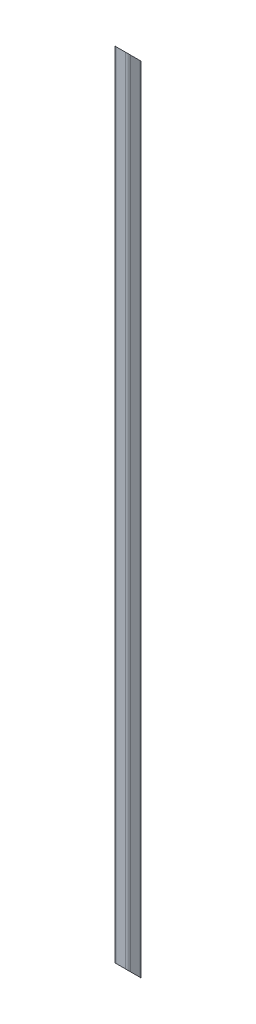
ISO-10303-21;
HEADER;
FILE_DESCRIPTION(('STEP AP214'),'2;1');
FILE_NAME('part.step','',(''),(''),'','','');
FILE_SCHEMA(('AUTOMOTIVE_DESIGN { 1 0 10303 214 1 1 1 1 }'));
ENDSEC;
DATA;
#1=APPLICATION_CONTEXT('core data for automotive mechanical design processes');
#2=APPLICATION_PROTOCOL_DEFINITION('international standard','automotive_design',2000,#1);
#3=PRODUCT_CONTEXT('',#1,'mechanical');
#4=PRODUCT('Part','Part','',(#3));
#5=PRODUCT_RELATED_PRODUCT_CATEGORY('part','',(#4));
#6=PRODUCT_DEFINITION_FORMATION('','',#4);
#7=PRODUCT_DEFINITION_CONTEXT('part definition',#1,'design');
#8=PRODUCT_DEFINITION('design','',#6,#7);
#9=PRODUCT_DEFINITION_SHAPE('','',#8);
#10=(LENGTH_UNIT() NAMED_UNIT(*) SI_UNIT(.MILLI.,.METRE.));
#11=(NAMED_UNIT(*) PLANE_ANGLE_UNIT() SI_UNIT($,.RADIAN.));
#12=(NAMED_UNIT(*) SI_UNIT($,.STERADIAN.) SOLID_ANGLE_UNIT());
#13=UNCERTAINTY_MEASURE_WITH_UNIT(LENGTH_MEASURE(1.E-05),#10,'distance_accuracy_value','');
#14=(GEOMETRIC_REPRESENTATION_CONTEXT(3) GLOBAL_UNCERTAINTY_ASSIGNED_CONTEXT((#13)) GLOBAL_UNIT_ASSIGNED_CONTEXT((#10,
#11,#12)) REPRESENTATION_CONTEXT('',''));
#15=CARTESIAN_POINT('',(0.,0.,0.));
#16=DIRECTION('',(0.,0.,1.));
#17=DIRECTION('',(1.,0.,0.));
#18=AXIS2_PLACEMENT_3D('',#15,#16,#17);
#19=CARTESIAN_POINT('',(12.9743199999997,2120.9,-12.9743199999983));
#20=DIRECTION('',(0.,-1.,0.));
#21=DIRECTION('',(0.,0.,-1.));
#22=AXIS2_PLACEMENT_3D('',#19,#20,#21);
#23=CYLINDRICAL_SURFACE('',#22,6.07568);
#24=DIRECTION('',(0.,-1.,0.));
#25=VECTOR('',#24,1.);
#26=CARTESIAN_POINT('',(12.9743199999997,2120.9,-19.0499999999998));
#27=LINE('',#26,#25);
#28=CARTESIAN_POINT('',(12.9743199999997,2082.8,-19.0499999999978));
#29=VERTEX_POINT('',#28);
#30=CARTESIAN_POINT('',(12.9743199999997,0.,-19.05));
#31=VERTEX_POINT('',#30);
#32=EDGE_CURVE('E217',#29,#31,#27,.T.);
#33=ORIENTED_EDGE('',*,*,#32,.F.);
#34=CARTESIAN_POINT('',(12.9743199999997,2088.87568,-12.9743199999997));
#35=DIRECTION('',(0.,-0.707106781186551,0.707106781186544));
#36=DIRECTION('',(0.,-0.707106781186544,-0.707106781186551));
#37=AXIS2_PLACEMENT_3D('',#34,#35,#36);
#38=ELLIPSE('',#37,8.59230905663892,6.07568);
#39=CARTESIAN_POINT('',(19.05,2088.87568,-12.9743199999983));
#40=VERTEX_POINT('',#39);
#41=EDGE_CURVE('E199',#29,#40,#38,.T.);
#42=ORIENTED_EDGE('',*,*,#41,.T.);
#43=DIRECTION('',(0.,-1.,0.));
#44=VECTOR('',#43,1.);
#45=CARTESIAN_POINT('',(19.05,2120.9,-12.9743199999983));
#46=LINE('',#45,#44);
#47=CARTESIAN_POINT('',(19.05,6.07567999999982,-12.9743199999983));
#48=VERTEX_POINT('',#47);
#49=EDGE_CURVE('E278',#40,#48,#46,.T.);
#50=ORIENTED_EDGE('',*,*,#49,.T.);
#51=CARTESIAN_POINT('',(12.9743199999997,6.07567999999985,-12.9743199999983));
#52=DIRECTION('',(0.,0.707106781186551,-0.707106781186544));
#53=DIRECTION('',(0.,-0.707106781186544,-0.707106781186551));
#54=AXIS2_PLACEMENT_3D('',#51,#52,#53);
#55=ELLIPSE('',#54,8.59230905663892,6.07568);
#56=EDGE_CURVE('E258',#48,#31,#55,.T.);
#57=ORIENTED_EDGE('',*,*,#56,.T.);
#58=EDGE_LOOP('',(#33,#42,#50,#57));
#59=FACE_BOUND('',#58,.T.);
#60=ADVANCED_FACE('F80',(#59),#23,.T.);
#61=CARTESIAN_POINT('',(-12.9743200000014,2120.9,-19.0499999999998));
#62=DIRECTION('',(0.,0.,1.));
#63=DIRECTION('',(1.,0.,0.));
#64=AXIS2_PLACEMENT_3D('',#61,#62,#63);
#65=PLANE('',#64);
#66=DIRECTION('',(0.,-1.,0.));
#67=VECTOR('',#66,1.);
#68=CARTESIAN_POINT('',(-12.9743200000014,2120.9,-19.0499999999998));
#69=LINE('',#68,#67);
#70=CARTESIAN_POINT('',(-12.9743200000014,2082.8,-19.0499999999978));
#71=VERTEX_POINT('',#70);
#72=CARTESIAN_POINT('',(-12.9743199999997,4.9960036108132E-13,-19.05));
#73=VERTEX_POINT('',#72);
#74=EDGE_CURVE('E215',#71,#73,#69,.T.);
#75=ORIENTED_EDGE('',*,*,#74,.F.);
#76=DIRECTION('',(-1.,0.,0.));
#77=VECTOR('',#76,1.);
#78=CARTESIAN_POINT('',(19.05,2082.8,-19.0499999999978));
#79=LINE('',#78,#77);
#80=EDGE_CURVE('E195',#29,#71,#79,.T.);
#81=ORIENTED_EDGE('',*,*,#80,.F.);
#82=ORIENTED_EDGE('',*,*,#32,.T.);
#83=DIRECTION('',(-1.,0.,0.));
#84=VECTOR('',#83,1.);
#85=CARTESIAN_POINT('',(-12.9743199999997,0.,-19.0500000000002));
#86=LINE('',#85,#84);
#87=EDGE_CURVE('E275',#31,#73,#86,.T.);
#88=ORIENTED_EDGE('',*,*,#87,.T.);
#89=EDGE_LOOP('',(#75,#81,#82,#88));
#90=FACE_BOUND('',#89,.T.);
#91=ADVANCED_FACE('F366',(#90),#65,.F.);
#92=CARTESIAN_POINT('',(-12.9743200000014,2120.9,-12.9743199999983));
#93=DIRECTION('',(0.,-1.,0.));
#94=DIRECTION('',(0.,0.,-1.));
#95=AXIS2_PLACEMENT_3D('',#92,#93,#94);
#96=CYLINDRICAL_SURFACE('',#95,6.07568);
#97=DIRECTION('',(0.,-1.,0.));
#98=VECTOR('',#97,1.);
#99=CARTESIAN_POINT('',(-19.05,2120.9,-12.9743199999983));
#100=LINE('',#99,#98);
#101=CARTESIAN_POINT('',(-19.05,2088.87568,-12.9743199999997));
#102=VERTEX_POINT('',#101);
#103=CARTESIAN_POINT('',(-19.05,6.07568000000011,-12.9743199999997));
#104=VERTEX_POINT('',#103);
#105=EDGE_CURVE('E206',#102,#104,#100,.T.);
#106=ORIENTED_EDGE('',*,*,#105,.F.);
#107=CARTESIAN_POINT('',(-12.9743200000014,2088.87568,-12.9743199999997));
#108=DIRECTION('',(0.,-0.707106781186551,0.707106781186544));
#109=DIRECTION('',(0.,-0.707106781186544,-0.707106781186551));
#110=AXIS2_PLACEMENT_3D('',#107,#108,#109);
#111=ELLIPSE('',#110,8.59230905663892,6.07568);
#112=EDGE_CURVE('E189',#102,#71,#111,.T.);
#113=ORIENTED_EDGE('',*,*,#112,.T.);
#114=ORIENTED_EDGE('',*,*,#74,.T.);
#115=CARTESIAN_POINT('',(-12.9743199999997,6.07568000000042,-12.9743200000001));
#116=DIRECTION('',(0.,0.707106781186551,-0.707106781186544));
#117=DIRECTION('',(0.,-0.707106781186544,-0.707106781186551));
#118=AXIS2_PLACEMENT_3D('',#115,#116,#117);
#119=ELLIPSE('',#118,8.59230905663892,6.07568);
#120=EDGE_CURVE('E214',#73,#104,#119,.T.);
#121=ORIENTED_EDGE('',*,*,#120,.T.);
#122=EDGE_LOOP('',(#106,#113,#114,#121));
#123=FACE_BOUND('',#122,.T.);
#124=ADVANCED_FACE('F212',(#123),#96,.T.);
#125=CARTESIAN_POINT('',(-19.05,2120.9,-12.9743199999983));
#126=DIRECTION('',(1.,0.,0.));
#127=DIRECTION('',(0.,0.,-1.));
#128=AXIS2_PLACEMENT_3D('',#125,#126,#127);
#129=PLANE('',#128);
#130=DIRECTION('',(0.,-1.,0.));
#131=VECTOR('',#130,1.);
#132=CARTESIAN_POINT('',(-19.05,2120.9,12.9743199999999));
#133=LINE('',#132,#131);
#134=CARTESIAN_POINT('',(-19.05,2114.82432,12.9743200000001));
#135=VERTEX_POINT('',#134);
#136=CARTESIAN_POINT('',(-19.05,32.0243199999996,12.9743200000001));
#137=VERTEX_POINT('',#136);
#138=EDGE_CURVE('E208',#135,#137,#133,.T.);
#139=ORIENTED_EDGE('',*,*,#138,.F.);
#140=DIRECTION('',(0.,0.707106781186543,0.707106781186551));
#141=VECTOR('',#140,1.);
#142=CARTESIAN_POINT('',(-19.05,2082.8,-19.0499999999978));
#143=LINE('',#142,#141);
#144=EDGE_CURVE('E192',#102,#135,#143,.T.);
#145=ORIENTED_EDGE('',*,*,#144,.F.);
#146=ORIENTED_EDGE('',*,*,#105,.T.);
#147=DIRECTION('',(0.,-0.707106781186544,-0.707106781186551));
#148=VECTOR('',#147,1.);
#149=CARTESIAN_POINT('',(-19.05,-1.38777878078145E-13,-19.0500000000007));
#150=LINE('',#149,#148);
#151=EDGE_CURVE('E298',#137,#104,#150,.T.);
#152=ORIENTED_EDGE('',*,*,#151,.F.);
#153=EDGE_LOOP('',(#139,#145,#146,#152));
#154=FACE_BOUND('',#153,.T.);
#155=ADVANCED_FACE('F204',(#154),#129,.F.);
#156=CARTESIAN_POINT('',(-12.9743200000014,2120.9,12.9743199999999));
#157=DIRECTION('',(0.,-1.,0.));
#158=DIRECTION('',(0.,0.,-1.));
#159=AXIS2_PLACEMENT_3D('',#156,#157,#158);
#160=CYLINDRICAL_SURFACE('',#159,6.07568);
#161=DIRECTION('',(0.,-1.,0.));
#162=VECTOR('',#161,1.);
#163=CARTESIAN_POINT('',(-12.9743200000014,2120.9,19.05));
#164=LINE('',#163,#162);
#165=CARTESIAN_POINT('',(-12.9743200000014,2120.9,19.05));
#166=VERTEX_POINT('',#165);
#167=CARTESIAN_POINT('',(-12.9743199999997,38.0999999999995,19.05));
#168=VERTEX_POINT('',#167);
#169=EDGE_CURVE('E219',#166,#168,#164,.T.);
#170=ORIENTED_EDGE('',*,*,#169,.F.);
#171=CARTESIAN_POINT('',(-12.9743200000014,2114.82432,12.9743200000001));
#172=DIRECTION('',(0.,-0.707106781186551,0.707106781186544));
#173=DIRECTION('',(0.,-0.707106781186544,-0.707106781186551));
#174=AXIS2_PLACEMENT_3D('',#171,#172,#173);
#175=ELLIPSE('',#174,8.59230905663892,6.07568);
#176=EDGE_CURVE('E200',#166,#135,#175,.T.);
#177=ORIENTED_EDGE('',*,*,#176,.T.);
#178=ORIENTED_EDGE('',*,*,#138,.T.);
#179=CARTESIAN_POINT('',(-12.9743199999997,32.0243199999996,12.9743200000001));
#180=DIRECTION('',(0.,0.707106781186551,-0.707106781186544));
#181=DIRECTION('',(0.,-0.707106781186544,-0.707106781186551));
#182=AXIS2_PLACEMENT_3D('',#179,#180,#181);
#183=ELLIPSE('',#182,8.59230905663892,6.07568);
#184=EDGE_CURVE('E249',#137,#168,#183,.T.);
#185=ORIENTED_EDGE('',*,*,#184,.T.);
#186=EDGE_LOOP('',(#170,#177,#178,#185));
#187=FACE_BOUND('',#186,.T.);
#188=ADVANCED_FACE('F295',(#187),#160,.T.);
#189=CARTESIAN_POINT('',(-12.9743200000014,2120.9,19.05));
#190=DIRECTION('',(0.,0.,-1.));
#191=DIRECTION('',(-1.,0.,0.));
#192=AXIS2_PLACEMENT_3D('',#189,#190,#191);
#193=PLANE('',#192);
#194=ORIENTED_EDGE('',*,*,#169,.T.);
#195=DIRECTION('',(-1.,0.,0.));
#196=VECTOR('',#195,1.);
#197=CARTESIAN_POINT('',(19.05,38.0999999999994,19.0500000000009));
#198=LINE('',#197,#196);
#199=CARTESIAN_POINT('',(12.9743199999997,38.0999999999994,19.0500000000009));
#200=VERTEX_POINT('',#199);
#201=EDGE_CURVE('E293',#200,#168,#198,.T.);
#202=ORIENTED_EDGE('',*,*,#201,.F.);
#203=DIRECTION('',(0.,-1.,0.));
#204=VECTOR('',#203,1.);
#205=CARTESIAN_POINT('',(12.9743199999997,2120.9,19.05));
#206=LINE('',#205,#204);
#207=CARTESIAN_POINT('',(12.9743199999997,2120.9,19.05));
#208=VERTEX_POINT('',#207);
#209=EDGE_CURVE('E284',#208,#200,#206,.T.);
#210=ORIENTED_EDGE('',*,*,#209,.F.);
#211=DIRECTION('',(1.,0.,0.));
#212=VECTOR('',#211,1.);
#213=CARTESIAN_POINT('',(-12.9743200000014,2120.9,19.05));
#214=LINE('',#213,#212);
#215=EDGE_CURVE('E276',#166,#208,#214,.T.);
#216=ORIENTED_EDGE('',*,*,#215,.F.);
#217=EDGE_LOOP('',(#194,#202,#210,#216));
#218=FACE_BOUND('',#217,.T.);
#219=ADVANCED_FACE('F291',(#218),#193,.F.);
#220=CARTESIAN_POINT('',(12.9743199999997,2120.9,12.9743199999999));
#221=DIRECTION('',(0.,-1.,0.));
#222=DIRECTION('',(0.,0.,-1.));
#223=AXIS2_PLACEMENT_3D('',#220,#221,#222);
#224=CYLINDRICAL_SURFACE('',#223,6.07568);
#225=DIRECTION('',(0.,-1.,0.));
#226=VECTOR('',#225,1.);
#227=CARTESIAN_POINT('',(19.05,2120.9,12.9743199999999));
#228=LINE('',#227,#226);
#229=CARTESIAN_POINT('',(19.05,2114.82432,12.9743200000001));
#230=VERTEX_POINT('',#229);
#231=CARTESIAN_POINT('',(19.05,32.0243200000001,12.9743200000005));
#232=VERTEX_POINT('',#231);
#233=EDGE_CURVE('E282',#230,#232,#228,.T.);
#234=ORIENTED_EDGE('',*,*,#233,.F.);
#235=CARTESIAN_POINT('',(12.9743199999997,2114.82432,12.9743200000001));
#236=DIRECTION('',(0.,-0.707106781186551,0.707106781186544));
#237=DIRECTION('',(0.,-0.707106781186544,-0.707106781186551));
#238=AXIS2_PLACEMENT_3D('',#235,#236,#237);
#239=ELLIPSE('',#238,8.59230905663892,6.07568);
#240=EDGE_CURVE('E94',#230,#208,#239,.T.);
#241=ORIENTED_EDGE('',*,*,#240,.T.);
#242=ORIENTED_EDGE('',*,*,#209,.T.);
#243=CARTESIAN_POINT('',(12.9743199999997,32.0243199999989,12.974320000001));
#244=DIRECTION('',(0.,0.707106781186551,-0.707106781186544));
#245=DIRECTION('',(0.,-0.707106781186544,-0.707106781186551));
#246=AXIS2_PLACEMENT_3D('',#243,#244,#245);
#247=ELLIPSE('',#246,8.59230905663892,6.07568);
#248=EDGE_CURVE('E245',#200,#232,#247,.T.);
#249=ORIENTED_EDGE('',*,*,#248,.T.);
#250=EDGE_LOOP('',(#234,#241,#242,#249));
#251=FACE_BOUND('',#250,.T.);
#252=ADVANCED_FACE('F357',(#251),#224,.T.);
#253=CARTESIAN_POINT('',(19.05,2120.9,-12.9743199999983));
#254=DIRECTION('',(-1.,0.,0.));
#255=DIRECTION('',(0.,0.,1.));
#256=AXIS2_PLACEMENT_3D('',#253,#254,#255);
#257=PLANE('',#256);
#258=ORIENTED_EDGE('',*,*,#49,.F.);
#259=DIRECTION('',(0.,0.707106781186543,0.707106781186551));
#260=VECTOR('',#259,1.);
#261=CARTESIAN_POINT('',(19.05,2082.8,-19.0499999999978));
#262=LINE('',#261,#260);
#263=EDGE_CURVE('E209',#40,#230,#262,.T.);
#264=ORIENTED_EDGE('',*,*,#263,.T.);
#265=ORIENTED_EDGE('',*,*,#233,.T.);
#266=DIRECTION('',(0.,-0.707106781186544,-0.707106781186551));
#267=VECTOR('',#266,1.);
#268=CARTESIAN_POINT('',(19.05,0.,-19.05));
#269=LINE('',#268,#267);
#270=EDGE_CURVE('E299',#232,#48,#269,.T.);
#271=ORIENTED_EDGE('',*,*,#270,.T.);
#272=EDGE_LOOP('',(#258,#264,#265,#271));
#273=FACE_BOUND('',#272,.T.);
#274=ADVANCED_FACE('F360',(#273),#257,.F.);
#275=CARTESIAN_POINT('',(12.9743199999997,2120.9,-12.9743199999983));
#276=DIRECTION('',(0.,-1.,0.));
#277=DIRECTION('',(0.,0.,-1.));
#278=AXIS2_PLACEMENT_3D('',#275,#276,#277);
#279=CYLINDRICAL_SURFACE('',#278,3.03784);
#280=CARTESIAN_POINT('',(12.9743199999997,2088.87568,-12.9743199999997));
#281=DIRECTION('',(0.,-0.707106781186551,0.707106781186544));
#282=DIRECTION('',(0.,-0.707106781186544,-0.707106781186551));
#283=AXIS2_PLACEMENT_3D('',#280,#281,#282);
#284=ELLIPSE('',#283,4.29615452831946,3.03784);
#285=CARTESIAN_POINT('',(12.9743199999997,2085.83784,-16.0121599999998));
#286=VERTEX_POINT('',#285);
#287=CARTESIAN_POINT('',(16.0121599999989,2088.87568,-12.9743199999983));
#288=VERTEX_POINT('',#287);
#289=EDGE_CURVE('E101',#286,#288,#284,.T.);
#290=ORIENTED_EDGE('',*,*,#289,.F.);
#291=DIRECTION('',(0.,-1.,0.));
#292=VECTOR('',#291,1.);
#293=CARTESIAN_POINT('',(12.9743199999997,2120.9,-16.0121600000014));
#294=LINE('',#293,#292);
#295=CARTESIAN_POINT('',(12.9743199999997,3.03784000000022,-16.0121600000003));
#296=VERTEX_POINT('',#295);
#297=EDGE_CURVE('E244',#286,#296,#294,.T.);
#298=ORIENTED_EDGE('',*,*,#297,.T.);
#299=CARTESIAN_POINT('',(12.9743199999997,6.07567999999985,-12.9743199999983));
#300=DIRECTION('',(0.,0.707106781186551,-0.707106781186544));
#301=DIRECTION('',(0.,-0.707106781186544,-0.707106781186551));
#302=AXIS2_PLACEMENT_3D('',#299,#300,#301);
#303=ELLIPSE('',#302,4.29615452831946,3.03784);
#304=CARTESIAN_POINT('',(16.0121600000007,6.07568000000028,-12.9743200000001));
#305=VERTEX_POINT('',#304);
#306=EDGE_CURVE('E232',#305,#296,#303,.T.);
#307=ORIENTED_EDGE('',*,*,#306,.F.);
#308=DIRECTION('',(0.,-1.,0.));
#309=VECTOR('',#308,1.);
#310=CARTESIAN_POINT('',(16.0121599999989,2120.9,-12.9743199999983));
#311=LINE('',#310,#309);
#312=EDGE_CURVE('E242',#288,#305,#311,.T.);
#313=ORIENTED_EDGE('',*,*,#312,.F.);
#314=EDGE_LOOP('',(#290,#298,#307,#313));
#315=FACE_BOUND('',#314,.T.);
#316=ADVANCED_FACE('F241',(#315),#279,.F.);
#317=CARTESIAN_POINT('',(-12.9743200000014,2120.9,-16.0121600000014));
#318=DIRECTION('',(0.,0.,1.));
#319=DIRECTION('',(1.,0.,0.));
#320=AXIS2_PLACEMENT_3D('',#317,#318,#319);
#321=PLANE('',#320);
#322=DIRECTION('',(1.,0.,0.));
#323=VECTOR('',#322,1.);
#324=CARTESIAN_POINT('',(-12.9743200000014,2085.83784,-16.0121599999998));
#325=LINE('',#324,#323);
#326=CARTESIAN_POINT('',(-12.9743200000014,2085.83784,-16.0121599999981));
#327=VERTEX_POINT('',#326);
#328=EDGE_CURVE('E351',#327,#286,#325,.T.);
#329=ORIENTED_EDGE('',*,*,#328,.F.);
#330=DIRECTION('',(0.,-1.,0.));
#331=VECTOR('',#330,1.);
#332=CARTESIAN_POINT('',(-12.9743200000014,2120.9,-16.0121600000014));
#333=LINE('',#332,#331);
#334=CARTESIAN_POINT('',(-12.9743199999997,3.03784000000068,-16.0121599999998));
#335=VERTEX_POINT('',#334);
#336=EDGE_CURVE('E272',#327,#335,#333,.T.);
#337=ORIENTED_EDGE('',*,*,#336,.T.);
#338=DIRECTION('',(-1.,0.,0.));
#339=VECTOR('',#338,1.);
#340=CARTESIAN_POINT('',(-12.9743199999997,3.03784000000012,-16.0121599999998));
#341=LINE('',#340,#339);
#342=EDGE_CURVE('E246',#296,#335,#341,.T.);
#343=ORIENTED_EDGE('',*,*,#342,.F.);
#344=ORIENTED_EDGE('',*,*,#297,.F.);
#345=EDGE_LOOP('',(#329,#337,#343,#344));
#346=FACE_BOUND('',#345,.T.);
#347=ADVANCED_FACE('F386',(#346),#321,.T.);
#348=CARTESIAN_POINT('',(-12.9743200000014,2120.9,-12.9743199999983));
#349=DIRECTION('',(0.,-1.,0.));
#350=DIRECTION('',(0.,0.,-1.));
#351=AXIS2_PLACEMENT_3D('',#348,#349,#350);
#352=CYLINDRICAL_SURFACE('',#351,3.03784);
#353=CARTESIAN_POINT('',(-12.9743200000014,2088.87568,-12.9743199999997));
#354=DIRECTION('',(0.,-0.707106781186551,0.707106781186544));
#355=DIRECTION('',(0.,-0.707106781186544,-0.707106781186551));
#356=AXIS2_PLACEMENT_3D('',#353,#354,#355);
#357=ELLIPSE('',#356,4.29615452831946,3.03784);
#358=CARTESIAN_POINT('',(-16.0121600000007,2088.87568,-12.9743199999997));
#359=VERTEX_POINT('',#358);
#360=EDGE_CURVE('E349',#359,#327,#357,.T.);
#361=ORIENTED_EDGE('',*,*,#360,.F.);
#362=DIRECTION('',(0.,-1.,0.));
#363=VECTOR('',#362,1.);
#364=CARTESIAN_POINT('',(-16.0121600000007,2120.9,-12.9743199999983));
#365=LINE('',#364,#363);
#366=CARTESIAN_POINT('',(-16.0121600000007,6.07568000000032,-12.9743200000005));
#367=VERTEX_POINT('',#366);
#368=EDGE_CURVE('E270',#359,#367,#365,.T.);
#369=ORIENTED_EDGE('',*,*,#368,.T.);
#370=CARTESIAN_POINT('',(-12.9743199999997,6.07568000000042,-12.9743200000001));
#371=DIRECTION('',(0.,0.707106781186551,-0.707106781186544));
#372=DIRECTION('',(0.,-0.707106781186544,-0.707106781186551));
#373=AXIS2_PLACEMENT_3D('',#370,#371,#372);
#374=ELLIPSE('',#373,4.29615452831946,3.03784);
#375=EDGE_CURVE('E251',#335,#367,#374,.T.);
#376=ORIENTED_EDGE('',*,*,#375,.F.);
#377=ORIENTED_EDGE('',*,*,#336,.F.);
#378=EDGE_LOOP('',(#361,#369,#376,#377));
#379=FACE_BOUND('',#378,.T.);
#380=ADVANCED_FACE('F389',(#379),#352,.F.);
#381=CARTESIAN_POINT('',(-16.0121600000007,2120.9,-12.9743199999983));
#382=DIRECTION('',(1.,0.,0.));
#383=DIRECTION('',(0.,0.,-1.));
#384=AXIS2_PLACEMENT_3D('',#381,#382,#383);
#385=PLANE('',#384);
#386=DIRECTION('',(0.,-0.707106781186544,-0.707106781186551));
#387=VECTOR('',#386,1.);
#388=CARTESIAN_POINT('',(-16.0121600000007,2104.88784,3.03784000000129));
#389=LINE('',#388,#387);
#390=CARTESIAN_POINT('',(-16.0121600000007,2114.82432,12.9743200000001));
#391=VERTEX_POINT('',#390);
#392=EDGE_CURVE('E326',#391,#359,#389,.T.);
#393=ORIENTED_EDGE('',*,*,#392,.F.);
#394=DIRECTION('',(0.,-1.,0.));
#395=VECTOR('',#394,1.);
#396=CARTESIAN_POINT('',(-16.0121600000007,2120.9,12.9743199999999));
#397=LINE('',#396,#395);
#398=CARTESIAN_POINT('',(-16.0121600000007,32.0243199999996,12.9743200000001));
#399=VERTEX_POINT('',#398);
#400=EDGE_CURVE('E268',#391,#399,#397,.T.);
#401=ORIENTED_EDGE('',*,*,#400,.T.);
#402=DIRECTION('',(0.,0.707106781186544,0.707106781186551));
#403=VECTOR('',#402,1.);
#404=CARTESIAN_POINT('',(-16.0121599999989,1063.48783999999,1044.43784));
#405=LINE('',#404,#403);
#406=EDGE_CURVE('E313',#367,#399,#405,.T.);
#407=ORIENTED_EDGE('',*,*,#406,.F.);
#408=ORIENTED_EDGE('',*,*,#368,.F.);
#409=EDGE_LOOP('',(#393,#401,#407,#408));
#410=FACE_BOUND('',#409,.T.);
#411=ADVANCED_FACE('F324',(#410),#385,.T.);
#412=CARTESIAN_POINT('',(-12.9743200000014,2120.9,12.9743199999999));
#413=DIRECTION('',(0.,-1.,0.));
#414=DIRECTION('',(0.,0.,-1.));
#415=AXIS2_PLACEMENT_3D('',#412,#413,#414);
#416=CYLINDRICAL_SURFACE('',#415,3.03784);
#417=CARTESIAN_POINT('',(-12.9743200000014,2114.82432,12.9743200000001));
#418=DIRECTION('',(0.,-0.707106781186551,0.707106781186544));
#419=DIRECTION('',(0.,-0.707106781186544,-0.707106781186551));
#420=AXIS2_PLACEMENT_3D('',#417,#418,#419);
#421=ELLIPSE('',#420,4.29615452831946,3.03784);
#422=CARTESIAN_POINT('',(-12.9743200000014,2117.86216,16.0121600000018));
#423=VERTEX_POINT('',#422);
#424=EDGE_CURVE('E330',#423,#391,#421,.T.);
#425=ORIENTED_EDGE('',*,*,#424,.F.);
#426=DIRECTION('',(0.,-1.,0.));
#427=VECTOR('',#426,1.);
#428=CARTESIAN_POINT('',(-12.9743200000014,2120.9,16.0121600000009));
#429=LINE('',#428,#427);
#430=CARTESIAN_POINT('',(-12.9743199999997,35.0621599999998,16.0121600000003));
#431=VERTEX_POINT('',#430);
#432=EDGE_CURVE('E266',#423,#431,#429,.T.);
#433=ORIENTED_EDGE('',*,*,#432,.T.);
#434=CARTESIAN_POINT('',(-12.9743199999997,32.0243199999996,12.9743200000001));
#435=DIRECTION('',(0.,0.707106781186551,-0.707106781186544));
#436=DIRECTION('',(0.,-0.707106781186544,-0.707106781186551));
#437=AXIS2_PLACEMENT_3D('',#434,#435,#436);
#438=ELLIPSE('',#437,4.29615452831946,3.03784);
#439=EDGE_CURVE('E310',#399,#431,#438,.T.);
#440=ORIENTED_EDGE('',*,*,#439,.F.);
#441=ORIENTED_EDGE('',*,*,#400,.F.);
#442=EDGE_LOOP('',(#425,#433,#440,#441));
#443=FACE_BOUND('',#442,.T.);
#444=ADVANCED_FACE('F329',(#443),#416,.F.);
#445=CARTESIAN_POINT('',(-12.9743200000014,2120.9,16.0121600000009));
#446=DIRECTION('',(0.,0.,-1.));
#447=DIRECTION('',(-1.,0.,0.));
#448=AXIS2_PLACEMENT_3D('',#445,#446,#447);
#449=PLANE('',#448);
#450=DIRECTION('',(-1.,0.,0.));
#451=VECTOR('',#450,1.);
#452=CARTESIAN_POINT('',(-12.9743200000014,2117.86216,16.0121600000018));
#453=LINE('',#452,#451);
#454=CARTESIAN_POINT('',(12.9743199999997,2117.86216,16.0121599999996));
#455=VERTEX_POINT('',#454);
#456=EDGE_CURVE('E337',#455,#423,#453,.T.);
#457=ORIENTED_EDGE('',*,*,#456,.F.);
#458=DIRECTION('',(0.,-1.,0.));
#459=VECTOR('',#458,1.);
#460=CARTESIAN_POINT('',(12.9743199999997,2120.9,16.0121600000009));
#461=LINE('',#460,#459);
#462=CARTESIAN_POINT('',(12.9743199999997,35.0621599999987,16.0121600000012));
#463=VERTEX_POINT('',#462);
#464=EDGE_CURVE('E264',#455,#463,#461,.T.);
#465=ORIENTED_EDGE('',*,*,#464,.T.);
#466=DIRECTION('',(1.,0.,0.));
#467=VECTOR('',#466,1.);
#468=CARTESIAN_POINT('',(-12.9743199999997,35.0621599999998,16.0121600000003));
#469=LINE('',#468,#467);
#470=EDGE_CURVE('E308',#431,#463,#469,.T.);
#471=ORIENTED_EDGE('',*,*,#470,.F.);
#472=ORIENTED_EDGE('',*,*,#432,.F.);
#473=EDGE_LOOP('',(#457,#465,#471,#472));
#474=FACE_BOUND('',#473,.T.);
#475=ADVANCED_FACE('F335',(#474),#449,.T.);
#476=CARTESIAN_POINT('',(12.9743199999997,2120.9,12.9743199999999));
#477=DIRECTION('',(0.,-1.,0.));
#478=DIRECTION('',(0.,0.,-1.));
#479=AXIS2_PLACEMENT_3D('',#476,#477,#478);
#480=CYLINDRICAL_SURFACE('',#479,3.03784);
#481=CARTESIAN_POINT('',(12.9743199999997,2114.82432,12.9743200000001));
#482=DIRECTION('',(0.,-0.707106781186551,0.707106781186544));
#483=DIRECTION('',(0.,-0.707106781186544,-0.707106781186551));
#484=AXIS2_PLACEMENT_3D('',#481,#482,#483);
#485=ELLIPSE('',#484,4.29615452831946,3.03784);
#486=CARTESIAN_POINT('',(16.0121599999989,2114.82432,12.9743200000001));
#487=VERTEX_POINT('',#486);
#488=EDGE_CURVE('E341',#487,#455,#485,.T.);
#489=ORIENTED_EDGE('',*,*,#488,.F.);
#490=DIRECTION('',(0.,-1.,0.));
#491=VECTOR('',#490,1.);
#492=CARTESIAN_POINT('',(16.0121599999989,2120.9,12.9743199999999));
#493=LINE('',#492,#491);
#494=CARTESIAN_POINT('',(16.0121599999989,32.0243200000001,12.9743200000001));
#495=VERTEX_POINT('',#494);
#496=EDGE_CURVE('E262',#487,#495,#493,.T.);
#497=ORIENTED_EDGE('',*,*,#496,.T.);
#498=CARTESIAN_POINT('',(12.9743199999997,32.0243199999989,12.974320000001));
#499=DIRECTION('',(0.,0.707106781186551,-0.707106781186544));
#500=DIRECTION('',(0.,-0.707106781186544,-0.707106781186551));
#501=AXIS2_PLACEMENT_3D('',#498,#499,#500);
#502=ELLIPSE('',#501,4.29615452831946,3.03784);
#503=EDGE_CURVE('E236',#463,#495,#502,.T.);
#504=ORIENTED_EDGE('',*,*,#503,.F.);
#505=ORIENTED_EDGE('',*,*,#464,.F.);
#506=EDGE_LOOP('',(#489,#497,#504,#505));
#507=FACE_BOUND('',#506,.T.);
#508=ADVANCED_FACE('F340',(#507),#480,.F.);
#509=CARTESIAN_POINT('',(16.0121599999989,2120.9,-12.9743199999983));
#510=DIRECTION('',(-1.,0.,0.));
#511=DIRECTION('',(0.,0.,1.));
#512=AXIS2_PLACEMENT_3D('',#509,#510,#511);
#513=PLANE('',#512);
#514=DIRECTION('',(0.,0.707106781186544,0.707106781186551));
#515=VECTOR('',#514,1.);
#516=CARTESIAN_POINT('',(16.0121599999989,2104.88784,3.03784000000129));
#517=LINE('',#516,#515);
#518=EDGE_CURVE('E12',#288,#487,#517,.T.);
#519=ORIENTED_EDGE('',*,*,#518,.F.);
#520=ORIENTED_EDGE('',*,*,#312,.T.);
#521=DIRECTION('',(0.,-0.707106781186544,-0.707106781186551));
#522=VECTOR('',#521,1.);
#523=CARTESIAN_POINT('',(16.0121600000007,1063.48783999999,1044.43784));
#524=LINE('',#523,#522);
#525=EDGE_CURVE('E87',#495,#305,#524,.T.);
#526=ORIENTED_EDGE('',*,*,#525,.F.);
#527=ORIENTED_EDGE('',*,*,#496,.F.);
#528=EDGE_LOOP('',(#519,#520,#526,#527));
#529=FACE_BOUND('',#528,.T.);
#530=ADVANCED_FACE('F342',(#529),#513,.T.);
#531=CARTESIAN_POINT('',(19.05,0.,-19.05));
#532=DIRECTION('',(0.,0.707106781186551,-0.707106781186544));
#533=DIRECTION('',(0.,0.707106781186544,0.707106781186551));
#534=AXIS2_PLACEMENT_3D('',#531,#532,#533);
#535=PLANE('',#534);
#536=ORIENTED_EDGE('',*,*,#306,.T.);
#537=ORIENTED_EDGE('',*,*,#342,.T.);
#538=ORIENTED_EDGE('',*,*,#375,.T.);
#539=ORIENTED_EDGE('',*,*,#406,.T.);
#540=ORIENTED_EDGE('',*,*,#439,.T.);
#541=ORIENTED_EDGE('',*,*,#470,.T.);
#542=ORIENTED_EDGE('',*,*,#503,.T.);
#543=ORIENTED_EDGE('',*,*,#525,.T.);
#544=EDGE_LOOP('',(#536,#537,#538,#539,#540,#541,#542,#543));
#545=FACE_BOUND('',#544,.T.);
#546=ORIENTED_EDGE('',*,*,#270,.F.);
#547=ORIENTED_EDGE('',*,*,#248,.F.);
#548=ORIENTED_EDGE('',*,*,#201,.T.);
#549=ORIENTED_EDGE('',*,*,#184,.F.);
#550=ORIENTED_EDGE('',*,*,#151,.T.);
#551=ORIENTED_EDGE('',*,*,#120,.F.);
#552=ORIENTED_EDGE('',*,*,#87,.F.);
#553=ORIENTED_EDGE('',*,*,#56,.F.);
#554=EDGE_LOOP('',(#546,#547,#548,#549,#550,#551,#552,#553));
#555=FACE_BOUND('',#554,.T.);
#556=ADVANCED_FACE('F229',(#545,#555),#535,.F.);
#557=CARTESIAN_POINT('',(19.05,2082.8,-19.0499999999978));
#558=DIRECTION('',(0.,-0.707106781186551,0.707106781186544));
#559=DIRECTION('',(0.,-0.707106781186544,-0.707106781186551));
#560=AXIS2_PLACEMENT_3D('',#557,#558,#559);
#561=PLANE('',#560);
#562=ORIENTED_EDGE('',*,*,#289,.T.);
#563=ORIENTED_EDGE('',*,*,#518,.T.);
#564=ORIENTED_EDGE('',*,*,#488,.T.);
#565=ORIENTED_EDGE('',*,*,#456,.T.);
#566=ORIENTED_EDGE('',*,*,#424,.T.);
#567=ORIENTED_EDGE('',*,*,#392,.T.);
#568=ORIENTED_EDGE('',*,*,#360,.T.);
#569=ORIENTED_EDGE('',*,*,#328,.T.);
#570=EDGE_LOOP('',(#562,#563,#564,#565,#566,#567,#568,#569));
#571=FACE_BOUND('',#570,.T.);
#572=ORIENTED_EDGE('',*,*,#80,.T.);
#573=ORIENTED_EDGE('',*,*,#112,.F.);
#574=ORIENTED_EDGE('',*,*,#144,.T.);
#575=ORIENTED_EDGE('',*,*,#176,.F.);
#576=ORIENTED_EDGE('',*,*,#215,.T.);
#577=ORIENTED_EDGE('',*,*,#240,.F.);
#578=ORIENTED_EDGE('',*,*,#263,.F.);
#579=ORIENTED_EDGE('',*,*,#41,.F.);
#580=EDGE_LOOP('',(#572,#573,#574,#575,#576,#577,#578,#579));
#581=FACE_BOUND('',#580,.T.);
#582=ADVANCED_FACE('F191',(#571,#581),#561,.F.);
#583=CLOSED_SHELL('',(#60,#91,#124,#155,#188,#219,#252,#274,#316,#347,#380,#411,#444,#475,#508,
#530,#556,#582));
#584=MANIFOLD_SOLID_BREP('B2',#583);
#585=ADVANCED_BREP_SHAPE_REPRESENTATION('',(#18,#584),#14);
#586=SHAPE_DEFINITION_REPRESENTATION(#9,#585);
ENDSEC;
END-ISO-10303-21;
